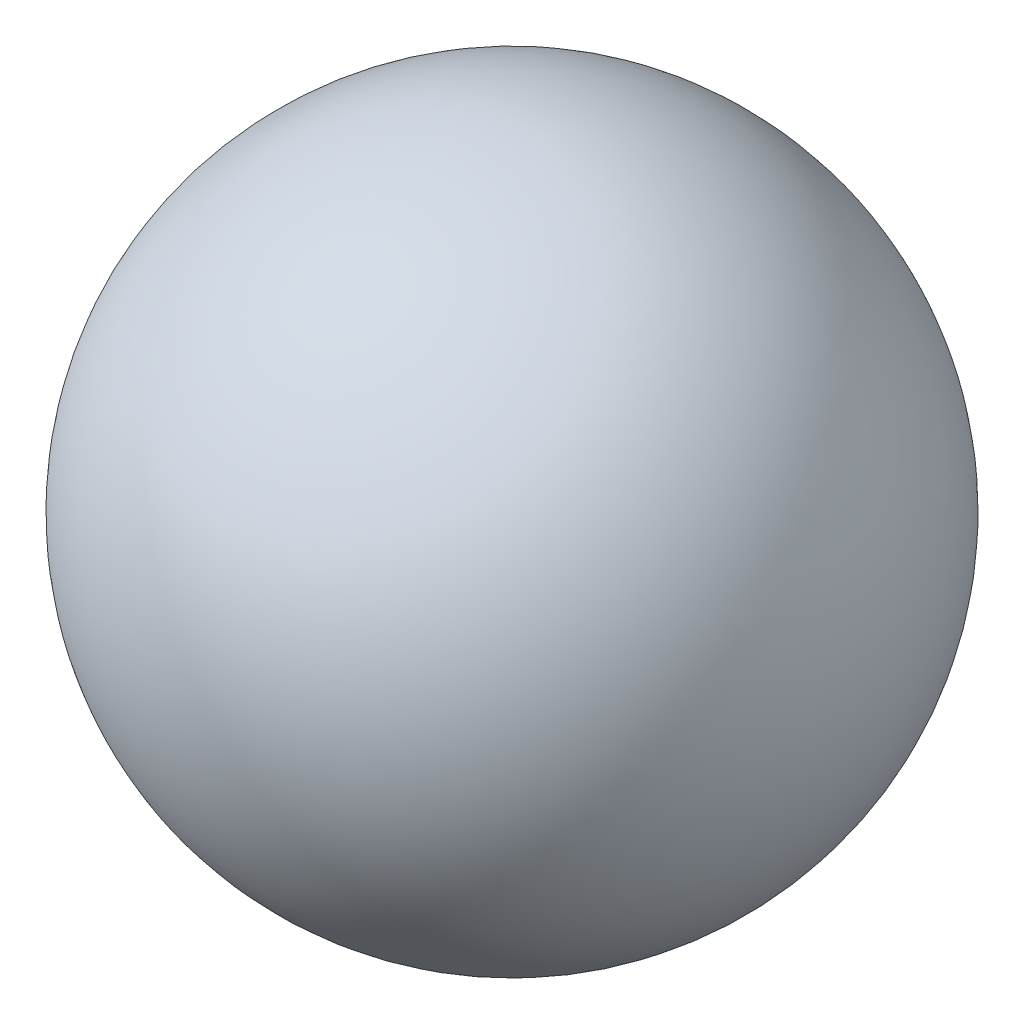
from build123d import *


with BuildPart() as part:
    # Esquisse1 → bille (revolve)
    with BuildSketch(Plane.XY):
        with BuildLine():
            Line((-2.25, 0), (2.25, 0))
            ThreePointArc((2.25, 0), (0, 2.25), (-2.25, 0))
        make_face()
    revolve(axis=Axis((-9, 0, 0), (1, 0, 0)))


solid = part.part
